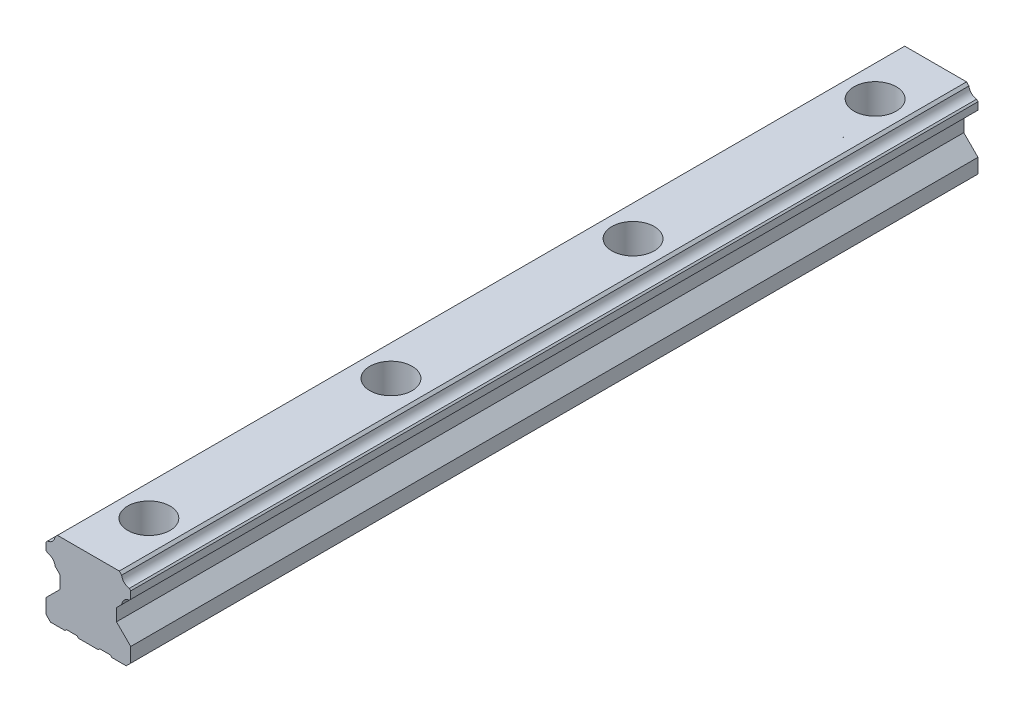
from build123d import *

# Parameters (mm, degrees)
BOSS_EXTRUDE1_DEPTH                                 = 140
CBORE_FOR_M4_HEX_SOCKET_HEAD_CAP_SCREW1_D           = 9
CBORE_FOR_M4_HEX_SOCKET_HEAD_CAP_SCREW1_CBORE_D     = 14
CBORE_FOR_M4_HEX_SOCKET_HEAD_CAP_SCREW1_CBORE_DEPTH = 12
LPATTERN1_COUNT                                     = 4
LPATTERN1_PITCH                                     = 80


with BuildPart() as part:
    # Sketch1 → Boss-Extrude1 (new, symmetric)
    with BuildSketch(Plane.XY):
        with BuildLine():
            Line((-11.000310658, 25.214692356), (-10.215003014, 26))
            Line((-10.215003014, 26), (10.215003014, 26))
            Line((10.215003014, 26), (11.000310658, 25.214692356))
            ThreePointArc((11.000310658, 25.214692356), (11.826090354, 23.516276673), (13.524505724, 22.690496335))
            Line((13.524505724, 22.690496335), (14, 22.215003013))
            Line((14, 22.215003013), (14, 19.779148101))
            Line((14, 19.779148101), (13.530870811, 19.31001796))
            ThreePointArc((13.530870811, 19.31001796), (11.82609074, 18.483479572), (10.999552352, 16.7786995))
            Line((10.999552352, 16.7786995), (9.300292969, 15.079440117))
            Line((9.300292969, 15.079440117), (9.300292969, 10.999628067))
            Line((9.300292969, 10.999628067), (14, 6.3))
            Line((14, 6.3), (14, 1.5))
            Line((14, 1.5), (12.5, 0))
            Line((12.5, 0), (7.75, 0))
            Line((7.75, 0), (7.25, 0.5))
            Line((7.25, 0.5), (3.75, 0.5))
            Line((3.75, 0.5), (3.25, 0))
            Line((3.25, 0), (-3.25, 0))
            Line((-3.25, 0), (-3.75, 0.5))
            Line((-3.75, 0.5), (-7.25, 0.5))
            Line((-7.25, 0.5), (-7.75, 0))
            Line((-7.75, 0), (-12.5, 0))
            Line((-12.5, 0), (-14, 1.5))
            Line((-14, 1.5), (-14, 6.3))
            Line((-14, 6.3), (-9.300292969, 10.999628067))
            Line((-9.300292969, 10.999628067), (-9.300292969, 15.079440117))
            Line((-9.300292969, 15.079440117), (-10.999552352, 16.7786995))
            ThreePointArc((-10.999552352, 16.7786995), (-11.82609074, 18.483479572), (-13.530870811, 19.31001796))
            Line((-13.530870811, 19.31001796), (-14, 19.779148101))
            Line((-14, 19.779148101), (-14, 22.215003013))
            Line((-14, 22.215003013), (-13.524505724, 22.690496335))
            ThreePointArc((-13.524505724, 22.690496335), (-11.826090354, 23.516276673), (-11.000310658, 25.214692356))
        make_face()
    extrude(amount=BOSS_EXTRUDE1_DEPTH, both=True)

    # CBORE for M4 Hex Socket Head Cap Screw1 (through all)
    with Locations(Plane(origin=(0, 26, 0), x_dir=(1, 0, 0), z_dir=(0, 1, 0))):
        with Locations((0, -120)):
            cbore_for_m4_hex_socket_head_cap_screw1 = CounterBoreHole(CBORE_FOR_M4_HEX_SOCKET_HEAD_CAP_SCREW1_D / 2, CBORE_FOR_M4_HEX_SOCKET_HEAD_CAP_SCREW1_CBORE_D / 2, CBORE_FOR_M4_HEX_SOCKET_HEAD_CAP_SCREW1_CBORE_DEPTH)

    # LPattern1: CBORE for M4 Hex Socket Head Cap Screw1 ×4
    with Locations(*[(0, 0, -i * LPATTERN1_PITCH) for i in range(1, LPATTERN1_COUNT)]):
        add(cbore_for_m4_hex_socket_head_cap_screw1, mode=Mode.SUBTRACT)


solid = part.part
